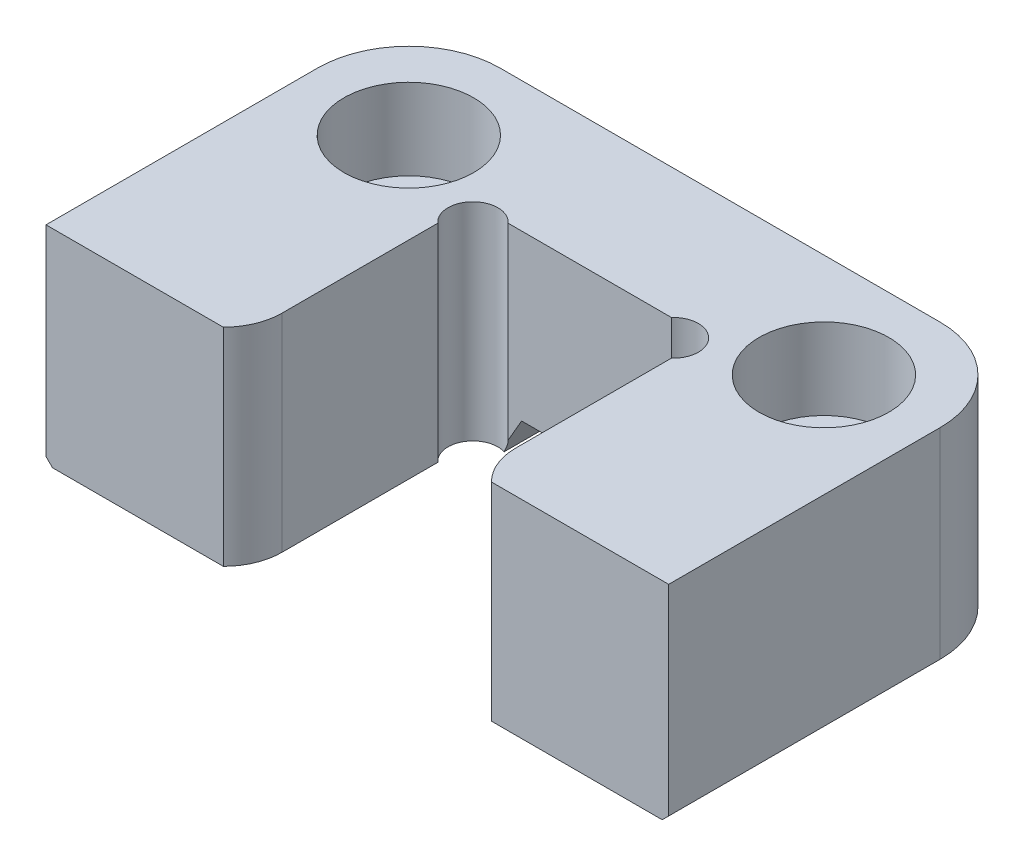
ISO-10303-21;
HEADER;
FILE_DESCRIPTION(('STEP AP214'),'2;1');
FILE_NAME('part.step','',(''),(''),'','','');
FILE_SCHEMA(('AUTOMOTIVE_DESIGN { 1 0 10303 214 1 1 1 1 }'));
ENDSEC;
DATA;
#1=APPLICATION_CONTEXT('core data for automotive mechanical design processes');
#2=APPLICATION_PROTOCOL_DEFINITION('international standard','automotive_design',2000,#1);
#3=PRODUCT_CONTEXT('',#1,'mechanical');
#4=PRODUCT('Part','Part','',(#3));
#5=PRODUCT_RELATED_PRODUCT_CATEGORY('part','',(#4));
#6=PRODUCT_DEFINITION_FORMATION('','',#4);
#7=PRODUCT_DEFINITION_CONTEXT('part definition',#1,'design');
#8=PRODUCT_DEFINITION('design','',#6,#7);
#9=PRODUCT_DEFINITION_SHAPE('','',#8);
#10=(LENGTH_UNIT() NAMED_UNIT(*) SI_UNIT(.MILLI.,.METRE.));
#11=(NAMED_UNIT(*) PLANE_ANGLE_UNIT() SI_UNIT($,.RADIAN.));
#12=(NAMED_UNIT(*) SI_UNIT($,.STERADIAN.) SOLID_ANGLE_UNIT());
#13=UNCERTAINTY_MEASURE_WITH_UNIT(LENGTH_MEASURE(1.E-05),#10,'distance_accuracy_value','');
#14=(GEOMETRIC_REPRESENTATION_CONTEXT(3) GLOBAL_UNCERTAINTY_ASSIGNED_CONTEXT((#13)) GLOBAL_UNIT_ASSIGNED_CONTEXT((#10,
#11,#12)) REPRESENTATION_CONTEXT('',''));
#15=CARTESIAN_POINT('',(0.,0.,0.));
#16=DIRECTION('',(0.,0.,1.));
#17=DIRECTION('',(1.,0.,0.));
#18=AXIS2_PLACEMENT_3D('',#15,#16,#17);
#19=CARTESIAN_POINT('',(-19.05,-12.6746,-22.1996));
#20=DIRECTION('',(0.,-1.,0.));
#21=DIRECTION('',(0.,0.,-1.));
#22=AXIS2_PLACEMENT_3D('',#19,#20,#21);
#23=PLANE('',#22);
#24=CARTESIAN_POINT('',(-12.7,-12.6746,-15.8496));
#25=DIRECTION('',(0.,1.,0.));
#26=DIRECTION('',(0.,0.,1.));
#27=AXIS2_PLACEMENT_3D('',#24,#25,#26);
#28=CIRCLE('',#27,2.2479);
#29=CARTESIAN_POINT('',(-12.7,-12.6746,-13.6017));
#30=VERTEX_POINT('',#29);
#31=EDGE_CURVE('E494',#30,#30,#28,.T.);
#32=ORIENTED_EDGE('',*,*,#31,.T.);
#33=EDGE_LOOP('',(#32));
#34=FACE_BOUND('',#33,.T.);
#35=CARTESIAN_POINT('',(-13.462,-12.6746,-16.6116));
#36=DIRECTION('',(0.,-1.,0.));
#37=DIRECTION('',(0.,0.,-1.));
#38=AXIS2_PLACEMENT_3D('',#35,#36,#37);
#39=CIRCLE('',#38,5.19112499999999);
#40=CARTESIAN_POINT('',(-18.653125,-12.6746,-16.6116));
#41=VERTEX_POINT('',#40);
#42=CARTESIAN_POINT('',(-13.462,-12.6746,-21.802725));
#43=VERTEX_POINT('',#42);
#44=EDGE_CURVE('E346',#41,#43,#39,.T.);
#45=ORIENTED_EDGE('',*,*,#44,.T.);
#46=DIRECTION('',(1.,0.,0.));
#47=VECTOR('',#46,1.);
#48=CARTESIAN_POINT('',(-19.05,-12.6746,-21.802725));
#49=LINE('',#48,#47);
#50=CARTESIAN_POINT('',(-5.67904355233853,-12.6746,-21.802725));
#51=VERTEX_POINT('',#50);
#52=EDGE_CURVE('E348',#43,#51,#49,.T.);
#53=ORIENTED_EDGE('',*,*,#52,.T.);
#54=DIRECTION('',(0.,0.,-1.));
#55=VECTOR('',#54,1.);
#56=CARTESIAN_POINT('',(-5.67904355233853,-12.6746,0.));
#57=LINE('',#56,#55);
#58=CARTESIAN_POINT('',(-5.67904355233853,-12.6746,-14.6624757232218));
#59=VERTEX_POINT('',#58);
#60=EDGE_CURVE('E220',#59,#51,#57,.T.);
#61=ORIENTED_EDGE('',*,*,#60,.F.);
#62=CARTESIAN_POINT('',(-6.1341,-12.6746,-13.208));
#63=DIRECTION('',(0.,1.,0.));
#64=DIRECTION('',(0.,0.,1.));
#65=AXIS2_PLACEMENT_3D('',#62,#63,#64);
#66=CIRCLE('',#65,1.524);
#67=CARTESIAN_POINT('',(-7.1501,-12.6746,-12.0720774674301));
#68=VERTEX_POINT('',#67);
#69=EDGE_CURVE('E237',#59,#68,#66,.T.);
#70=ORIENTED_EDGE('',*,*,#69,.T.);
#71=DIRECTION('',(0.,0.,-1.));
#72=VECTOR('',#71,1.);
#73=CARTESIAN_POINT('',(-7.1501,-12.6746,0.));
#74=LINE('',#73,#72);
#75=CARTESIAN_POINT('',(-7.1501,-12.6746,-2.54));
#76=VERTEX_POINT('',#75);
#77=EDGE_CURVE('E270',#76,#68,#74,.T.);
#78=ORIENTED_EDGE('',*,*,#77,.F.);
#79=CARTESIAN_POINT('',(-10.7414602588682,-12.6746,-2.54));
#80=DIRECTION('',(0.,-1.,0.));
#81=DIRECTION('',(0.,0.,1.));
#82=AXIS2_PLACEMENT_3D('',#79,#80,#81);
#83=CIRCLE('',#82,3.59136025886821);
#84=CARTESIAN_POINT('',(-8.20250998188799,-12.6746,0.));
#85=VERTEX_POINT('',#84);
#86=EDGE_CURVE('E246',#76,#85,#83,.T.);
#87=ORIENTED_EDGE('',*,*,#86,.T.);
#88=DIRECTION('',(1.,0.,0.));
#89=VECTOR('',#88,1.);
#90=CARTESIAN_POINT('',(-19.05,-12.6746,0.));
#91=LINE('',#90,#89);
#92=CARTESIAN_POINT('',(-18.653125,-12.6746,0.));
#93=VERTEX_POINT('',#92);
#94=EDGE_CURVE('E268',#93,#85,#91,.T.);
#95=ORIENTED_EDGE('',*,*,#94,.F.);
#96=DIRECTION('',(0.,0.,-1.));
#97=VECTOR('',#96,1.);
#98=CARTESIAN_POINT('',(-18.653125,-12.6746,-22.1996));
#99=LINE('',#98,#97);
#100=EDGE_CURVE('E344',#93,#41,#99,.T.);
#101=ORIENTED_EDGE('',*,*,#100,.T.);
#102=EDGE_LOOP('',(#45,#53,#61,#70,#78,#87,#95,#101));
#103=FACE_BOUND('',#102,.T.);
#104=ADVANCED_FACE('F34',(#34,#103),#23,.T.);
#105=CARTESIAN_POINT('',(-19.05,-12.6746,0.));
#106=DIRECTION('',(-1.,0.,0.));
#107=DIRECTION('',(0.,0.,1.));
#108=AXIS2_PLACEMENT_3D('',#105,#106,#107);
#109=PLANE('',#108);
#110=DIRECTION('',(0.,1.,0.));
#111=VECTOR('',#110,1.);
#112=CARTESIAN_POINT('',(-19.05,-12.6746,-16.6116));
#113=LINE('',#112,#111);
#114=CARTESIAN_POINT('',(-19.05,0.,-16.6116));
#115=VERTEX_POINT('',#114);
#116=CARTESIAN_POINT('',(-19.05,-12.277725,-16.6116));
#117=VERTEX_POINT('',#116);
#118=EDGE_CURVE('E313',#115,#117,#113,.F.);
#119=ORIENTED_EDGE('',*,*,#118,.T.);
#120=DIRECTION('',(0.,0.,1.));
#121=VECTOR('',#120,1.);
#122=CARTESIAN_POINT('',(-19.05,-12.277725,0.));
#123=LINE('',#122,#121);
#124=CARTESIAN_POINT('',(-19.05,-12.277725,0.));
#125=VERTEX_POINT('',#124);
#126=EDGE_CURVE('E353',#117,#125,#123,.T.);
#127=ORIENTED_EDGE('',*,*,#126,.T.);
#128=DIRECTION('',(0.,1.,0.));
#129=VECTOR('',#128,1.);
#130=CARTESIAN_POINT('',(-19.05,-12.6746,0.));
#131=LINE('',#130,#129);
#132=CARTESIAN_POINT('',(-19.05,0.,0.));
#133=VERTEX_POINT('',#132);
#134=EDGE_CURVE('E279',#125,#133,#131,.T.);
#135=ORIENTED_EDGE('',*,*,#134,.T.);
#136=DIRECTION('',(0.,0.,1.));
#137=VECTOR('',#136,1.);
#138=CARTESIAN_POINT('',(-19.05,0.,0.));
#139=LINE('',#138,#137);
#140=EDGE_CURVE('E260',#115,#133,#139,.T.);
#141=ORIENTED_EDGE('',*,*,#140,.F.);
#142=EDGE_LOOP('',(#119,#127,#135,#141));
#143=FACE_BOUND('',#142,.T.);
#144=ADVANCED_FACE('F422',(#143),#109,.T.);
#145=CARTESIAN_POINT('',(-19.05,-12.6746,-22.1996));
#146=DIRECTION('',(0.,0.,-1.));
#147=DIRECTION('',(-1.,0.,0.));
#148=AXIS2_PLACEMENT_3D('',#145,#146,#147);
#149=PLANE('',#148);
#150=DIRECTION('',(0.,1.,0.));
#151=VECTOR('',#150,1.);
#152=CARTESIAN_POINT('',(13.462,-12.6746,-22.1996));
#153=LINE('',#152,#151);
#154=CARTESIAN_POINT('',(13.462,0.,-22.1996));
#155=VERTEX_POINT('',#154);
#156=CARTESIAN_POINT('',(13.462,-12.277725,-22.1996));
#157=VERTEX_POINT('',#156);
#158=EDGE_CURVE('E311',#155,#157,#153,.F.);
#159=ORIENTED_EDGE('',*,*,#158,.T.);
#160=DIRECTION('',(-1.,0.,0.));
#161=VECTOR('',#160,1.);
#162=CARTESIAN_POINT('',(-19.05,-12.277725,-22.1996));
#163=LINE('',#162,#161);
#164=CARTESIAN_POINT('',(5.44990766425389,-12.277725,-22.1996));
#165=VERTEX_POINT('',#164);
#166=EDGE_CURVE('E340',#157,#165,#163,.T.);
#167=ORIENTED_EDGE('',*,*,#166,.T.);
#168=DIRECTION('',(0.499999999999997,-0.866025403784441,0.));
#169=VECTOR('',#168,1.);
#170=CARTESIAN_POINT('',(4.7625,-11.0871,-22.1996));
#171=LINE('',#170,#169);
#172=CARTESIAN_POINT('',(4.7625,-11.0871,-22.1996));
#173=VERTEX_POINT('',#172);
#174=EDGE_CURVE('E200',#173,#165,#171,.T.);
#175=ORIENTED_EDGE('',*,*,#174,.F.);
#176=DIRECTION('',(1.,0.,0.));
#177=VECTOR('',#176,1.);
#178=CARTESIAN_POINT('',(4.7625,-11.0871,-22.1996));
#179=LINE('',#178,#177);
#180=CARTESIAN_POINT('',(-4.7625,-11.0871,-22.1996));
#181=VERTEX_POINT('',#180);
#182=EDGE_CURVE('E194',#181,#173,#179,.T.);
#183=ORIENTED_EDGE('',*,*,#182,.F.);
#184=DIRECTION('',(0.499999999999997,0.866025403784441,0.));
#185=VECTOR('',#184,1.);
#186=CARTESIAN_POINT('',(-4.7625,-11.0871,-22.1996));
#187=LINE('',#186,#185);
#188=CARTESIAN_POINT('',(-5.44990766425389,-12.277725,-22.1996));
#189=VERTEX_POINT('',#188);
#190=EDGE_CURVE('E203',#189,#181,#187,.T.);
#191=ORIENTED_EDGE('',*,*,#190,.F.);
#192=DIRECTION('',(-1.,0.,0.));
#193=VECTOR('',#192,1.);
#194=CARTESIAN_POINT('',(-19.05,-12.277725,-22.1996));
#195=LINE('',#194,#193);
#196=CARTESIAN_POINT('',(-13.462,-12.277725,-22.1996));
#197=VERTEX_POINT('',#196);
#198=EDGE_CURVE('E338',#189,#197,#195,.T.);
#199=ORIENTED_EDGE('',*,*,#198,.T.);
#200=DIRECTION('',(0.,1.,0.));
#201=VECTOR('',#200,1.);
#202=CARTESIAN_POINT('',(-13.462,-12.6746,-22.1996));
#203=LINE('',#202,#201);
#204=CARTESIAN_POINT('',(-13.462,0.,-22.1996));
#205=VERTEX_POINT('',#204);
#206=EDGE_CURVE('E309',#197,#205,#203,.T.);
#207=ORIENTED_EDGE('',*,*,#206,.T.);
#208=DIRECTION('',(-1.,0.,0.));
#209=VECTOR('',#208,1.);
#210=CARTESIAN_POINT('',(-19.05,0.,-22.1996));
#211=LINE('',#210,#209);
#212=EDGE_CURVE('E271',#155,#205,#211,.T.);
#213=ORIENTED_EDGE('',*,*,#212,.F.);
#214=EDGE_LOOP('',(#159,#167,#175,#183,#191,#199,#207,#213));
#215=FACE_BOUND('',#214,.T.);
#216=ADVANCED_FACE('F214',(#215),#149,.T.);
#217=CARTESIAN_POINT('',(19.05,-12.6746,0.));
#218=DIRECTION('',(1.,0.,0.));
#219=DIRECTION('',(0.,0.,-1.));
#220=AXIS2_PLACEMENT_3D('',#217,#218,#219);
#221=PLANE('',#220);
#222=DIRECTION('',(0.,1.,0.));
#223=VECTOR('',#222,1.);
#224=CARTESIAN_POINT('',(19.05,-12.6746,0.));
#225=LINE('',#224,#223);
#226=CARTESIAN_POINT('',(19.05,-12.277725,0.));
#227=VERTEX_POINT('',#226);
#228=CARTESIAN_POINT('',(19.05,0.,0.));
#229=VERTEX_POINT('',#228);
#230=EDGE_CURVE('E300',#227,#229,#225,.T.);
#231=ORIENTED_EDGE('',*,*,#230,.F.);
#232=DIRECTION('',(0.,0.,-1.));
#233=VECTOR('',#232,1.);
#234=CARTESIAN_POINT('',(19.05,-12.277725,0.));
#235=LINE('',#234,#233);
#236=CARTESIAN_POINT('',(19.05,-12.277725,-16.6116));
#237=VERTEX_POINT('',#236);
#238=EDGE_CURVE('E325',#227,#237,#235,.T.);
#239=ORIENTED_EDGE('',*,*,#238,.T.);
#240=DIRECTION('',(0.,1.,0.));
#241=VECTOR('',#240,1.);
#242=CARTESIAN_POINT('',(19.05,-12.6746,-16.6116));
#243=LINE('',#242,#241);
#244=CARTESIAN_POINT('',(19.05,0.,-16.6116));
#245=VERTEX_POINT('',#244);
#246=EDGE_CURVE('E302',#237,#245,#243,.T.);
#247=ORIENTED_EDGE('',*,*,#246,.T.);
#248=DIRECTION('',(0.,0.,-1.));
#249=VECTOR('',#248,1.);
#250=CARTESIAN_POINT('',(19.05,0.,0.));
#251=LINE('',#250,#249);
#252=EDGE_CURVE('E295',#229,#245,#251,.T.);
#253=ORIENTED_EDGE('',*,*,#252,.F.);
#254=EDGE_LOOP('',(#231,#239,#247,#253));
#255=FACE_BOUND('',#254,.T.);
#256=ADVANCED_FACE('F406',(#255),#221,.T.);
#257=CARTESIAN_POINT('',(7.1501,-12.6746,0.));
#258=DIRECTION('',(0.,0.,1.));
#259=DIRECTION('',(1.,0.,0.));
#260=AXIS2_PLACEMENT_3D('',#257,#258,#259);
#261=PLANE('',#260);
#262=DIRECTION('',(1.,0.,0.));
#263=VECTOR('',#262,1.);
#264=CARTESIAN_POINT('',(7.1501,-12.6746,0.));
#265=LINE('',#264,#263);
#266=CARTESIAN_POINT('',(8.20250998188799,-12.6746,0.));
#267=VERTEX_POINT('',#266);
#268=CARTESIAN_POINT('',(18.653125,-12.6746,0.));
#269=VERTEX_POINT('',#268);
#270=EDGE_CURVE('E276',#267,#269,#265,.T.);
#271=ORIENTED_EDGE('',*,*,#270,.T.);
#272=DIRECTION('',(-0.707106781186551,-0.707106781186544,0.));
#273=VECTOR('',#272,1.);
#274=CARTESIAN_POINT('',(12.9016124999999,-18.4261125,0.));
#275=LINE('',#274,#273);
#276=EDGE_CURVE('E334',#269,#227,#275,.F.);
#277=ORIENTED_EDGE('',*,*,#276,.T.);
#278=ORIENTED_EDGE('',*,*,#230,.T.);
#279=DIRECTION('',(1.,0.,0.));
#280=VECTOR('',#279,1.);
#281=CARTESIAN_POINT('',(7.1501,0.,0.));
#282=LINE('',#281,#280);
#283=CARTESIAN_POINT('',(8.20250998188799,0.,0.));
#284=VERTEX_POINT('',#283);
#285=EDGE_CURVE('E292',#284,#229,#282,.T.);
#286=ORIENTED_EDGE('',*,*,#285,.F.);
#287=DIRECTION('',(0.,1.,0.));
#288=VECTOR('',#287,1.);
#289=CARTESIAN_POINT('',(8.20250998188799,-12.6746,0.));
#290=LINE('',#289,#288);
#291=EDGE_CURVE('E264',#267,#284,#290,.T.);
#292=ORIENTED_EDGE('',*,*,#291,.F.);
#293=EDGE_LOOP('',(#271,#277,#278,#286,#292));
#294=FACE_BOUND('',#293,.T.);
#295=ADVANCED_FACE('F396',(#294),#261,.T.);
#296=CARTESIAN_POINT('',(7.1501,-12.6746,0.));
#297=DIRECTION('',(-1.,0.,0.));
#298=DIRECTION('',(0.,0.,1.));
#299=AXIS2_PLACEMENT_3D('',#296,#297,#298);
#300=PLANE('',#299);
#301=DIRECTION('',(0.,1.,0.));
#302=VECTOR('',#301,1.);
#303=CARTESIAN_POINT('',(7.1501,-12.6746,-12.0720774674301));
#304=LINE('',#303,#302);
#305=CARTESIAN_POINT('',(7.1501,-12.6746,-12.0720774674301));
#306=VERTEX_POINT('',#305);
#307=CARTESIAN_POINT('',(7.1501,0.,-12.0720774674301));
#308=VERTEX_POINT('',#307);
#309=EDGE_CURVE('E234',#306,#308,#304,.T.);
#310=ORIENTED_EDGE('',*,*,#309,.F.);
#311=DIRECTION('',(0.,0.,1.));
#312=VECTOR('',#311,1.);
#313=CARTESIAN_POINT('',(7.1501,-12.6746,0.));
#314=LINE('',#313,#312);
#315=CARTESIAN_POINT('',(7.1501,-12.6746,-2.54));
#316=VERTEX_POINT('',#315);
#317=EDGE_CURVE('E274',#306,#316,#314,.T.);
#318=ORIENTED_EDGE('',*,*,#317,.T.);
#319=DIRECTION('',(0.,1.,0.));
#320=VECTOR('',#319,1.);
#321=CARTESIAN_POINT('',(7.1501,-12.6746,-2.54));
#322=LINE('',#321,#320);
#323=CARTESIAN_POINT('',(7.1501,0.,-2.54));
#324=VERTEX_POINT('',#323);
#325=EDGE_CURVE('E261',#316,#324,#322,.T.);
#326=ORIENTED_EDGE('',*,*,#325,.T.);
#327=DIRECTION('',(0.,0.,1.));
#328=VECTOR('',#327,1.);
#329=CARTESIAN_POINT('',(7.1501,0.,0.));
#330=LINE('',#329,#328);
#331=EDGE_CURVE('E290',#308,#324,#330,.T.);
#332=ORIENTED_EDGE('',*,*,#331,.F.);
#333=EDGE_LOOP('',(#310,#318,#326,#332));
#334=FACE_BOUND('',#333,.T.);
#335=ADVANCED_FACE('F384',(#334),#300,.T.);
#336=CARTESIAN_POINT('',(-7.1501,-12.6746,-14.224));
#337=DIRECTION('',(0.,0.,1.));
#338=DIRECTION('',(1.,0.,0.));
#339=AXIS2_PLACEMENT_3D('',#336,#337,#338);
#340=PLANE('',#339);
#341=DIRECTION('',(-0.499999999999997,-0.866025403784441,0.));
#342=VECTOR('',#341,1.);
#343=CARTESIAN_POINT('',(-6.04680766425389,-13.3115861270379,-14.224));
#344=LINE('',#343,#342);
#345=CARTESIAN_POINT('',(-4.17309094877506,-10.0662135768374,-14.224));
#346=VERTEX_POINT('',#345);
#347=CARTESIAN_POINT('',(-4.9981774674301,-11.4953053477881,-14.224));
#348=VERTEX_POINT('',#347);
#349=EDGE_CURVE('E49',#346,#348,#344,.T.);
#350=ORIENTED_EDGE('',*,*,#349,.F.);
#351=DIRECTION('',(1.,0.,0.));
#352=VECTOR('',#351,1.);
#353=CARTESIAN_POINT('',(4.7625,-10.0662135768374,-14.224));
#354=LINE('',#353,#352);
#355=CARTESIAN_POINT('',(4.17309094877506,-10.0662135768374,-14.224));
#356=VERTEX_POINT('',#355);
#357=EDGE_CURVE('E368',#346,#356,#354,.T.);
#358=ORIENTED_EDGE('',*,*,#357,.T.);
#359=DIRECTION('',(-0.499999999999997,0.866025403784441,0.));
#360=VECTOR('',#359,1.);
#361=CARTESIAN_POINT('',(2.47175766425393,-7.11941788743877,-14.224));
#362=LINE('',#361,#360);
#363=CARTESIAN_POINT('',(4.99817746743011,-11.4953053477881,-14.224));
#364=VERTEX_POINT('',#363);
#365=EDGE_CURVE('E56',#364,#356,#362,.T.);
#366=ORIENTED_EDGE('',*,*,#365,.F.);
#367=DIRECTION('',(0.,1.,0.));
#368=VECTOR('',#367,1.);
#369=CARTESIAN_POINT('',(4.99817746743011,-12.6746,-14.224));
#370=LINE('',#369,#368);
#371=CARTESIAN_POINT('',(4.99817746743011,0.,-14.224));
#372=VERTEX_POINT('',#371);
#373=EDGE_CURVE('E231',#372,#364,#370,.F.);
#374=ORIENTED_EDGE('',*,*,#373,.F.);
#375=DIRECTION('',(1.,0.,0.));
#376=VECTOR('',#375,1.);
#377=CARTESIAN_POINT('',(-7.1501,0.,-14.224));
#378=LINE('',#377,#376);
#379=CARTESIAN_POINT('',(-4.99817746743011,0.,-14.224));
#380=VERTEX_POINT('',#379);
#381=EDGE_CURVE('E287',#380,#372,#378,.T.);
#382=ORIENTED_EDGE('',*,*,#381,.F.);
#383=DIRECTION('',(0.,1.,0.));
#384=VECTOR('',#383,1.);
#385=CARTESIAN_POINT('',(-4.9981774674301,-12.6746,-14.224));
#386=LINE('',#385,#384);
#387=EDGE_CURVE('E243',#348,#380,#386,.T.);
#388=ORIENTED_EDGE('',*,*,#387,.F.);
#389=EDGE_LOOP('',(#350,#358,#366,#374,#382,#388));
#390=FACE_BOUND('',#389,.T.);
#391=ADVANCED_FACE('F372',(#390),#340,.T.);
#392=CARTESIAN_POINT('',(-7.1501,-12.6746,0.));
#393=DIRECTION('',(1.,0.,0.));
#394=DIRECTION('',(0.,0.,-1.));
#395=AXIS2_PLACEMENT_3D('',#392,#393,#394);
#396=PLANE('',#395);
#397=DIRECTION('',(0.,1.,0.));
#398=VECTOR('',#397,1.);
#399=CARTESIAN_POINT('',(-7.1501,-12.6746,-12.0720774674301));
#400=LINE('',#399,#398);
#401=CARTESIAN_POINT('',(-7.1501,0.,-12.0720774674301));
#402=VERTEX_POINT('',#401);
#403=EDGE_CURVE('E239',#402,#68,#400,.F.);
#404=ORIENTED_EDGE('',*,*,#403,.F.);
#405=DIRECTION('',(0.,0.,-1.));
#406=VECTOR('',#405,1.);
#407=CARTESIAN_POINT('',(-7.1501,0.,0.));
#408=LINE('',#407,#406);
#409=CARTESIAN_POINT('',(-7.1501,0.,-2.54));
#410=VERTEX_POINT('',#409);
#411=EDGE_CURVE('E284',#410,#402,#408,.T.);
#412=ORIENTED_EDGE('',*,*,#411,.F.);
#413=DIRECTION('',(0.,1.,0.));
#414=VECTOR('',#413,1.);
#415=CARTESIAN_POINT('',(-7.1501,-12.6746,-2.54));
#416=LINE('',#415,#414);
#417=EDGE_CURVE('E258',#76,#410,#416,.T.);
#418=ORIENTED_EDGE('',*,*,#417,.F.);
#419=ORIENTED_EDGE('',*,*,#77,.T.);
#420=EDGE_LOOP('',(#404,#412,#418,#419));
#421=FACE_BOUND('',#420,.T.);
#422=ADVANCED_FACE('F445',(#421),#396,.T.);
#423=CARTESIAN_POINT('',(-19.05,-12.6746,0.));
#424=DIRECTION('',(0.,0.,1.));
#425=DIRECTION('',(1.,0.,0.));
#426=AXIS2_PLACEMENT_3D('',#423,#424,#425);
#427=PLANE('',#426);
#428=ORIENTED_EDGE('',*,*,#134,.F.);
#429=DIRECTION('',(-0.707106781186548,0.707106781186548,0.));
#430=VECTOR('',#429,1.);
#431=CARTESIAN_POINT('',(-18.8515625,-12.4761625,0.));
#432=LINE('',#431,#430);
#433=EDGE_CURVE('E355',#125,#93,#432,.F.);
#434=ORIENTED_EDGE('',*,*,#433,.T.);
#435=ORIENTED_EDGE('',*,*,#94,.T.);
#436=DIRECTION('',(0.,1.,0.));
#437=VECTOR('',#436,1.);
#438=CARTESIAN_POINT('',(-8.20250998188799,-12.6746,0.));
#439=LINE('',#438,#437);
#440=CARTESIAN_POINT('',(-8.20250998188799,0.,0.));
#441=VERTEX_POINT('',#440);
#442=EDGE_CURVE('E253',#85,#441,#439,.T.);
#443=ORIENTED_EDGE('',*,*,#442,.T.);
#444=DIRECTION('',(1.,0.,0.));
#445=VECTOR('',#444,1.);
#446=CARTESIAN_POINT('',(-19.05,0.,0.));
#447=LINE('',#446,#445);
#448=EDGE_CURVE('E282',#133,#441,#447,.T.);
#449=ORIENTED_EDGE('',*,*,#448,.F.);
#450=EDGE_LOOP('',(#428,#434,#435,#443,#449));
#451=FACE_BOUND('',#450,.T.);
#452=ADVANCED_FACE('F427',(#451),#427,.T.);
#453=CARTESIAN_POINT('',(12.7,-12.6746,-15.8496));
#454=DIRECTION('',(0.,1.,0.));
#455=DIRECTION('',(0.,0.,1.));
#456=AXIS2_PLACEMENT_3D('',#453,#454,#455);
#457=CIRCLE('',#456,2.2479);
#458=CARTESIAN_POINT('',(12.7,-12.6746,-13.6017));
#459=VERTEX_POINT('',#458);
#460=EDGE_CURVE('E364',#459,#459,#457,.T.);
#461=ORIENTED_EDGE('',*,*,#460,.T.);
#462=EDGE_LOOP('',(#461));
#463=FACE_BOUND('',#462,.T.);
#464=CARTESIAN_POINT('',(13.462,-12.6746,-16.6116));
#465=DIRECTION('',(0.,-1.,0.));
#466=DIRECTION('',(0.,0.,-1.));
#467=AXIS2_PLACEMENT_3D('',#464,#465,#466);
#468=CIRCLE('',#467,5.19112499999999);
#469=CARTESIAN_POINT('',(13.462,-12.6746,-21.802725));
#470=VERTEX_POINT('',#469);
#471=CARTESIAN_POINT('',(18.653125,-12.6746,-16.6116));
#472=VERTEX_POINT('',#471);
#473=EDGE_CURVE('E330',#470,#472,#468,.T.);
#474=ORIENTED_EDGE('',*,*,#473,.T.);
#475=DIRECTION('',(0.,0.,1.));
#476=VECTOR('',#475,1.);
#477=CARTESIAN_POINT('',(18.653125,-12.6746,-22.1996));
#478=LINE('',#477,#476);
#479=EDGE_CURVE('E332',#472,#269,#478,.T.);
#480=ORIENTED_EDGE('',*,*,#479,.T.);
#481=ORIENTED_EDGE('',*,*,#270,.F.);
#482=CARTESIAN_POINT('',(10.7414602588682,-12.6746,-2.54));
#483=DIRECTION('',(0.,-1.,0.));
#484=DIRECTION('',(0.,0.,-1.));
#485=AXIS2_PLACEMENT_3D('',#482,#483,#484);
#486=CIRCLE('',#485,3.59136025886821);
#487=EDGE_CURVE('E249',#267,#316,#486,.T.);
#488=ORIENTED_EDGE('',*,*,#487,.T.);
#489=ORIENTED_EDGE('',*,*,#317,.F.);
#490=CARTESIAN_POINT('',(6.1341,-12.6746,-13.208));
#491=DIRECTION('',(0.,1.,0.));
#492=DIRECTION('',(0.,0.,-1.));
#493=AXIS2_PLACEMENT_3D('',#490,#491,#492);
#494=CIRCLE('',#493,1.524);
#495=CARTESIAN_POINT('',(5.67904355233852,-12.6746,-14.6624757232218));
#496=VERTEX_POINT('',#495);
#497=EDGE_CURVE('E228',#306,#496,#494,.T.);
#498=ORIENTED_EDGE('',*,*,#497,.T.);
#499=DIRECTION('',(0.,0.,-1.));
#500=VECTOR('',#499,1.);
#501=CARTESIAN_POINT('',(5.67904355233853,-12.6746,0.));
#502=LINE('',#501,#500);
#503=CARTESIAN_POINT('',(5.67904355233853,-12.6746,-21.802725));
#504=VERTEX_POINT('',#503);
#505=EDGE_CURVE('E222',#496,#504,#502,.T.);
#506=ORIENTED_EDGE('',*,*,#505,.T.);
#507=DIRECTION('',(1.,0.,0.));
#508=VECTOR('',#507,1.);
#509=CARTESIAN_POINT('',(-19.05,-12.6746,-21.802725));
#510=LINE('',#509,#508);
#511=EDGE_CURVE('E328',#504,#470,#510,.T.);
#512=ORIENTED_EDGE('',*,*,#511,.T.);
#513=EDGE_LOOP('',(#474,#480,#481,#488,#489,#498,#506,#512));
#514=FACE_BOUND('',#513,.T.);
#515=ADVANCED_FACE('F392',(#463,#514),#23,.T.);
#516=CARTESIAN_POINT('',(-19.05,0.,-22.1996));
#517=DIRECTION('',(0.,-1.,0.));
#518=DIRECTION('',(0.,0.,-1.));
#519=AXIS2_PLACEMENT_3D('',#516,#517,#518);
#520=PLANE('',#519);
#521=CARTESIAN_POINT('',(-12.7,0.,-15.8496));
#522=DIRECTION('',(0.,1.,0.));
#523=DIRECTION('',(0.,0.,1.));
#524=AXIS2_PLACEMENT_3D('',#521,#522,#523);
#525=CIRCLE('',#524,3.96875);
#526=CARTESIAN_POINT('',(-12.7,0.,-11.88085));
#527=VERTEX_POINT('',#526);
#528=EDGE_CURVE('E502',#527,#527,#525,.T.);
#529=ORIENTED_EDGE('',*,*,#528,.F.);
#530=EDGE_LOOP('',(#529));
#531=FACE_BOUND('',#530,.T.);
#532=CARTESIAN_POINT('',(12.7,0.,-15.8496));
#533=DIRECTION('',(0.,1.,0.));
#534=DIRECTION('',(0.,0.,1.));
#535=AXIS2_PLACEMENT_3D('',#532,#533,#534);
#536=CIRCLE('',#535,3.96875);
#537=CARTESIAN_POINT('',(12.7,0.,-11.88085));
#538=VERTEX_POINT('',#537);
#539=EDGE_CURVE('E491',#538,#538,#536,.T.);
#540=ORIENTED_EDGE('',*,*,#539,.F.);
#541=EDGE_LOOP('',(#540));
#542=FACE_BOUND('',#541,.T.);
#543=ORIENTED_EDGE('',*,*,#381,.T.);
#544=CARTESIAN_POINT('',(6.1341,0.,-13.208));
#545=DIRECTION('',(0.,-1.,0.));
#546=DIRECTION('',(0.,0.,-1.));
#547=AXIS2_PLACEMENT_3D('',#544,#545,#546);
#548=CIRCLE('',#547,1.524);
#549=EDGE_CURVE('E316',#372,#308,#548,.T.);
#550=ORIENTED_EDGE('',*,*,#549,.T.);
#551=ORIENTED_EDGE('',*,*,#331,.T.);
#552=CARTESIAN_POINT('',(10.7414602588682,0.,-2.54));
#553=DIRECTION('',(0.,-1.,0.));
#554=DIRECTION('',(0.,0.,-1.));
#555=AXIS2_PLACEMENT_3D('',#552,#553,#554);
#556=CIRCLE('',#555,3.59136025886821);
#557=EDGE_CURVE('E250',#284,#324,#556,.T.);
#558=ORIENTED_EDGE('',*,*,#557,.F.);
#559=ORIENTED_EDGE('',*,*,#285,.T.);
#560=ORIENTED_EDGE('',*,*,#252,.T.);
#561=CARTESIAN_POINT('',(13.462,0.,-16.6116));
#562=DIRECTION('',(0.,-1.,0.));
#563=DIRECTION('',(0.,0.,-1.));
#564=AXIS2_PLACEMENT_3D('',#561,#562,#563);
#565=CIRCLE('',#564,5.588);
#566=EDGE_CURVE('E307',#245,#155,#565,.F.);
#567=ORIENTED_EDGE('',*,*,#566,.T.);
#568=ORIENTED_EDGE('',*,*,#212,.T.);
#569=CARTESIAN_POINT('',(-13.462,0.,-16.6116));
#570=DIRECTION('',(0.,-1.,0.));
#571=DIRECTION('',(0.,0.,-1.));
#572=AXIS2_PLACEMENT_3D('',#569,#570,#571);
#573=CIRCLE('',#572,5.588);
#574=EDGE_CURVE('E305',#205,#115,#573,.F.);
#575=ORIENTED_EDGE('',*,*,#574,.T.);
#576=ORIENTED_EDGE('',*,*,#140,.T.);
#577=ORIENTED_EDGE('',*,*,#448,.T.);
#578=CARTESIAN_POINT('',(-10.7414602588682,0.,-2.54));
#579=DIRECTION('',(0.,-1.,0.));
#580=DIRECTION('',(0.,0.,1.));
#581=AXIS2_PLACEMENT_3D('',#578,#579,#580);
#582=CIRCLE('',#581,3.59136025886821);
#583=EDGE_CURVE('E245',#410,#441,#582,.T.);
#584=ORIENTED_EDGE('',*,*,#583,.F.);
#585=ORIENTED_EDGE('',*,*,#411,.T.);
#586=CARTESIAN_POINT('',(-6.1341,0.,-13.208));
#587=DIRECTION('',(0.,1.,0.));
#588=DIRECTION('',(0.,0.,1.));
#589=AXIS2_PLACEMENT_3D('',#586,#587,#588);
#590=CIRCLE('',#589,1.524);
#591=EDGE_CURVE('E236',#380,#402,#590,.T.);
#592=ORIENTED_EDGE('',*,*,#591,.F.);
#593=EDGE_LOOP('',(#543,#550,#551,#558,#559,#560,#567,#568,#575,#576,#577,#584,#585,#592));
#594=FACE_BOUND('',#593,.T.);
#595=ADVANCED_FACE('F380',(#531,#542,#594),#520,.F.);
#596=CARTESIAN_POINT('',(13.462,-12.6746,-16.6116));
#597=DIRECTION('',(0.,1.,0.));
#598=DIRECTION('',(0.,0.,1.));
#599=AXIS2_PLACEMENT_3D('',#596,#597,#598);
#600=CYLINDRICAL_SURFACE('',#599,5.588);
#601=ORIENTED_EDGE('',*,*,#246,.F.);
#602=CARTESIAN_POINT('',(13.462,-12.277725,-16.6116));
#603=DIRECTION('',(0.,-1.,0.));
#604=DIRECTION('',(0.,0.,-1.));
#605=AXIS2_PLACEMENT_3D('',#602,#603,#604);
#606=CIRCLE('',#605,5.588);
#607=EDGE_CURVE('E336',#237,#157,#606,.F.);
#608=ORIENTED_EDGE('',*,*,#607,.T.);
#609=ORIENTED_EDGE('',*,*,#158,.F.);
#610=ORIENTED_EDGE('',*,*,#566,.F.);
#611=EDGE_LOOP('',(#601,#608,#609,#610));
#612=FACE_BOUND('',#611,.T.);
#613=ADVANCED_FACE('F410',(#612),#600,.T.);
#614=CARTESIAN_POINT('',(-13.462,-12.6746,-16.6116));
#615=DIRECTION('',(0.,1.,0.));
#616=DIRECTION('',(0.,0.,1.));
#617=AXIS2_PLACEMENT_3D('',#614,#615,#616);
#618=CYLINDRICAL_SURFACE('',#617,5.588);
#619=ORIENTED_EDGE('',*,*,#206,.F.);
#620=CARTESIAN_POINT('',(-13.462,-12.277725,-16.6116));
#621=DIRECTION('',(0.,-1.,0.));
#622=DIRECTION('',(0.,0.,-1.));
#623=AXIS2_PLACEMENT_3D('',#620,#621,#622);
#624=CIRCLE('',#623,5.588);
#625=EDGE_CURVE('E351',#197,#117,#624,.F.);
#626=ORIENTED_EDGE('',*,*,#625,.T.);
#627=ORIENTED_EDGE('',*,*,#118,.F.);
#628=ORIENTED_EDGE('',*,*,#574,.F.);
#629=EDGE_LOOP('',(#619,#626,#627,#628));
#630=FACE_BOUND('',#629,.T.);
#631=ADVANCED_FACE('F418',(#630),#618,.T.);
#632=CARTESIAN_POINT('',(10.7414602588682,-12.6746,-2.54));
#633=DIRECTION('',(0.,1.,0.));
#634=DIRECTION('',(0.,0.,1.));
#635=AXIS2_PLACEMENT_3D('',#632,#633,#634);
#636=CYLINDRICAL_SURFACE('',#635,3.59136025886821);
#637=ORIENTED_EDGE('',*,*,#557,.T.);
#638=ORIENTED_EDGE('',*,*,#325,.F.);
#639=ORIENTED_EDGE('',*,*,#487,.F.);
#640=ORIENTED_EDGE('',*,*,#291,.T.);
#641=EDGE_LOOP('',(#637,#638,#639,#640));
#642=FACE_BOUND('',#641,.T.);
#643=ADVANCED_FACE('F388',(#642),#636,.T.);
#644=CARTESIAN_POINT('',(-10.7414602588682,-12.6746,-2.54));
#645=DIRECTION('',(0.,1.,0.));
#646=DIRECTION('',(0.,0.,1.));
#647=AXIS2_PLACEMENT_3D('',#644,#645,#646);
#648=CYLINDRICAL_SURFACE('',#647,3.59136025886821);
#649=ORIENTED_EDGE('',*,*,#583,.T.);
#650=ORIENTED_EDGE('',*,*,#442,.F.);
#651=ORIENTED_EDGE('',*,*,#86,.F.);
#652=ORIENTED_EDGE('',*,*,#417,.T.);
#653=EDGE_LOOP('',(#649,#650,#651,#652));
#654=FACE_BOUND('',#653,.T.);
#655=ADVANCED_FACE('F439',(#654),#648,.T.);
#656=CARTESIAN_POINT('',(-6.1341,-12.6746,-13.208));
#657=DIRECTION('',(0.,1.,0.));
#658=DIRECTION('',(0.,0.,1.));
#659=AXIS2_PLACEMENT_3D('',#656,#657,#658);
#660=CYLINDRICAL_SURFACE('',#659,1.524);
#661=ORIENTED_EDGE('',*,*,#69,.F.);
#662=CARTESIAN_POINT('',(-6.1341,-13.4627808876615,-13.208));
#663=DIRECTION('',(-0.866025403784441,0.499999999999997,0.));
#664=DIRECTION('',(0.499999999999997,0.866025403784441,0.));
#665=AXIS2_PLACEMENT_3D('',#662,#663,#664);
#666=ELLIPSE('',#665,3.04800000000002,1.524);
#667=EDGE_CURVE('E322',#59,#348,#666,.F.);
#668=ORIENTED_EDGE('',*,*,#667,.T.);
#669=ORIENTED_EDGE('',*,*,#387,.T.);
#670=ORIENTED_EDGE('',*,*,#591,.T.);
#671=ORIENTED_EDGE('',*,*,#403,.T.);
#672=EDGE_LOOP('',(#661,#668,#669,#670,#671));
#673=FACE_BOUND('',#672,.T.);
#674=ADVANCED_FACE('F448',(#673),#660,.F.);
#675=CARTESIAN_POINT('',(6.1341,-12.6746,-13.208));
#676=DIRECTION('',(0.,1.,0.));
#677=DIRECTION('',(0.,0.,1.));
#678=AXIS2_PLACEMENT_3D('',#675,#676,#677);
#679=CYLINDRICAL_SURFACE('',#678,1.524);
#680=ORIENTED_EDGE('',*,*,#373,.T.);
#681=CARTESIAN_POINT('',(6.1341,-13.4627808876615,-13.208));
#682=DIRECTION('',(0.866025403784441,0.499999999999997,0.));
#683=DIRECTION('',(-0.499999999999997,0.866025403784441,0.));
#684=AXIS2_PLACEMENT_3D('',#681,#682,#683);
#685=ELLIPSE('',#684,3.04800000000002,1.524);
#686=EDGE_CURVE('E319',#364,#496,#685,.F.);
#687=ORIENTED_EDGE('',*,*,#686,.T.);
#688=ORIENTED_EDGE('',*,*,#497,.F.);
#689=ORIENTED_EDGE('',*,*,#309,.T.);
#690=ORIENTED_EDGE('',*,*,#549,.F.);
#691=EDGE_LOOP('',(#680,#687,#688,#689,#690));
#692=FACE_BOUND('',#691,.T.);
#693=ADVANCED_FACE('F376',(#692),#679,.F.);
#694=CARTESIAN_POINT('',(-4.7625,-11.0871,0.));
#695=DIRECTION('',(-0.866025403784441,0.499999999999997,0.));
#696=DIRECTION('',(-0.499999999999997,-0.866025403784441,0.));
#697=AXIS2_PLACEMENT_3D('',#694,#695,#696);
#698=PLANE('',#697);
#699=ORIENTED_EDGE('',*,*,#60,.T.);
#700=DIRECTION('',(-0.377964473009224,-0.654653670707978,0.654653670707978));
#701=VECTOR('',#700,1.);
#702=CARTESIAN_POINT('',(-7.39277799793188,-15.6428751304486,-18.8344498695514));
#703=LINE('',#702,#701);
#704=EDGE_CURVE('E207',#51,#189,#703,.F.);
#705=ORIENTED_EDGE('',*,*,#704,.T.);
#706=ORIENTED_EDGE('',*,*,#190,.T.);
#707=DIRECTION('',(0.,0.,-1.));
#708=VECTOR('',#707,1.);
#709=CARTESIAN_POINT('',(-4.7625,-11.0871,0.));
#710=LINE('',#709,#708);
#711=CARTESIAN_POINT('',(-4.7625,-11.0871,-18.0340000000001));
#712=VERTEX_POINT('',#711);
#713=EDGE_CURVE('E189',#712,#181,#710,.T.);
#714=ORIENTED_EDGE('',*,*,#713,.F.);
#715=DIRECTION('',(0.147788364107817,0.255976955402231,0.955319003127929));
#716=VECTOR('',#715,1.);
#717=CARTESIAN_POINT('',(-2.21636912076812,-6.67707195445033,-1.57555127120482));
#718=LINE('',#717,#716);
#719=EDGE_CURVE('E42',#712,#346,#718,.T.);
#720=ORIENTED_EDGE('',*,*,#719,.T.);
#721=ORIENTED_EDGE('',*,*,#349,.T.);
#722=ORIENTED_EDGE('',*,*,#667,.F.);
#723=EDGE_LOOP('',(#699,#705,#706,#714,#720,#721,#722));
#724=FACE_BOUND('',#723,.T.);
#725=ADVANCED_FACE('F205',(#724),#698,.F.);
#726=CARTESIAN_POINT('',(4.7625,-11.0871,0.));
#727=DIRECTION('',(0.866025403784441,0.499999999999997,0.));
#728=DIRECTION('',(-0.499999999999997,0.866025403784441,0.));
#729=AXIS2_PLACEMENT_3D('',#726,#727,#728);
#730=PLANE('',#729);
#731=ORIENTED_EDGE('',*,*,#174,.T.);
#732=DIRECTION('',(-0.377964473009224,0.654653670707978,-0.654653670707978));
#733=VECTOR('',#732,1.);
#734=CARTESIAN_POINT('',(1.94992085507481,-6.21557002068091,-28.2617549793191));
#735=LINE('',#734,#733);
#736=EDGE_CURVE('E342',#165,#504,#735,.F.);
#737=ORIENTED_EDGE('',*,*,#736,.T.);
#738=ORIENTED_EDGE('',*,*,#505,.F.);
#739=ORIENTED_EDGE('',*,*,#686,.F.);
#740=ORIENTED_EDGE('',*,*,#365,.T.);
#741=DIRECTION('',(0.147788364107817,-0.255976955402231,-0.955319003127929));
#742=VECTOR('',#741,1.);
#743=CARTESIAN_POINT('',(2.21636912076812,-6.67707195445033,-1.57555127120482));
#744=LINE('',#743,#742);
#745=CARTESIAN_POINT('',(4.7625,-11.0871,-18.0340000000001));
#746=VERTEX_POINT('',#745);
#747=EDGE_CURVE('E11',#356,#746,#744,.T.);
#748=ORIENTED_EDGE('',*,*,#747,.T.);
#749=DIRECTION('',(0.,0.,-1.));
#750=VECTOR('',#749,1.);
#751=CARTESIAN_POINT('',(4.7625,-11.0871,0.));
#752=LINE('',#751,#750);
#753=EDGE_CURVE('E199',#746,#173,#752,.T.);
#754=ORIENTED_EDGE('',*,*,#753,.T.);
#755=EDGE_LOOP('',(#731,#737,#738,#739,#740,#748,#754));
#756=FACE_BOUND('',#755,.T.);
#757=ADVANCED_FACE('F531',(#756),#730,.F.);
#758=CARTESIAN_POINT('',(4.7625,-11.0871,0.));
#759=DIRECTION('',(0.,1.,0.));
#760=DIRECTION('',(0.,0.,1.));
#761=AXIS2_PLACEMENT_3D('',#758,#759,#760);
#762=PLANE('',#761);
#763=ORIENTED_EDGE('',*,*,#753,.F.);
#764=DIRECTION('',(-1.,0.,0.));
#765=VECTOR('',#764,1.);
#766=CARTESIAN_POINT('',(-4.7625,-11.0871,-18.0340000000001));
#767=LINE('',#766,#765);
#768=EDGE_CURVE('E197',#746,#712,#767,.T.);
#769=ORIENTED_EDGE('',*,*,#768,.T.);
#770=ORIENTED_EDGE('',*,*,#713,.T.);
#771=ORIENTED_EDGE('',*,*,#182,.T.);
#772=EDGE_LOOP('',(#763,#769,#770,#771));
#773=FACE_BOUND('',#772,.T.);
#774=ADVANCED_FACE('F192',(#773),#762,.F.);
#775=CARTESIAN_POINT('',(-19.05,-12.277725,-22.1996));
#776=DIRECTION('',(0.,0.707106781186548,0.707106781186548));
#777=DIRECTION('',(0.,-0.707106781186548,0.707106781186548));
#778=AXIS2_PLACEMENT_3D('',#775,#776,#777);
#779=PLANE('',#778);
#780=ORIENTED_EDGE('',*,*,#736,.F.);
#781=ORIENTED_EDGE('',*,*,#166,.F.);
#782=DIRECTION('',(0.,0.707106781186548,-0.707106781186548));
#783=VECTOR('',#782,1.);
#784=CARTESIAN_POINT('',(13.462,-12.6746,-21.802725));
#785=LINE('',#784,#783);
#786=EDGE_CURVE('E211',#470,#157,#785,.T.);
#787=ORIENTED_EDGE('',*,*,#786,.F.);
#788=ORIENTED_EDGE('',*,*,#511,.F.);
#789=EDGE_LOOP('',(#780,#781,#787,#788));
#790=FACE_BOUND('',#789,.T.);
#791=ADVANCED_FACE('F536',(#790),#779,.F.);
#792=CARTESIAN_POINT('',(13.462,-12.6746,-16.6116));
#793=DIRECTION('',(0.,1.,0.));
#794=DIRECTION('',(0.,0.,1.));
#795=AXIS2_PLACEMENT_3D('',#792,#793,#794);
#796=CONICAL_SURFACE('',#795,5.19112499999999,0.785398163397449);
#797=ORIENTED_EDGE('',*,*,#786,.T.);
#798=ORIENTED_EDGE('',*,*,#607,.F.);
#799=DIRECTION('',(0.707106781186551,0.707106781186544,0.));
#800=VECTOR('',#799,1.);
#801=CARTESIAN_POINT('',(18.653125,-12.6746,-16.6116));
#802=LINE('',#801,#800);
#803=EDGE_CURVE('E357',#472,#237,#802,.T.);
#804=ORIENTED_EDGE('',*,*,#803,.F.);
#805=ORIENTED_EDGE('',*,*,#473,.F.);
#806=EDGE_LOOP('',(#797,#798,#804,#805));
#807=FACE_BOUND('',#806,.T.);
#808=ADVANCED_FACE('F581',(#807),#796,.T.);
#809=CARTESIAN_POINT('',(19.05,-12.277725,0.));
#810=DIRECTION('',(-0.707106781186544,0.707106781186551,0.));
#811=DIRECTION('',(-0.707106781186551,-0.707106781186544,0.));
#812=AXIS2_PLACEMENT_3D('',#809,#810,#811);
#813=PLANE('',#812);
#814=ORIENTED_EDGE('',*,*,#276,.F.);
#815=ORIENTED_EDGE('',*,*,#479,.F.);
#816=ORIENTED_EDGE('',*,*,#803,.T.);
#817=ORIENTED_EDGE('',*,*,#238,.F.);
#818=EDGE_LOOP('',(#814,#815,#816,#817));
#819=FACE_BOUND('',#818,.T.);
#820=ADVANCED_FACE('F401',(#819),#813,.F.);
#821=CARTESIAN_POINT('',(-19.05,-12.277725,0.));
#822=DIRECTION('',(0.707106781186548,0.707106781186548,0.));
#823=DIRECTION('',(-0.707106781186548,0.707106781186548,0.));
#824=AXIS2_PLACEMENT_3D('',#821,#822,#823);
#825=PLANE('',#824);
#826=ORIENTED_EDGE('',*,*,#433,.F.);
#827=ORIENTED_EDGE('',*,*,#126,.F.);
#828=DIRECTION('',(-0.707106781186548,0.707106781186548,0.));
#829=VECTOR('',#828,1.);
#830=CARTESIAN_POINT('',(-18.653125,-12.6746,-16.6116));
#831=LINE('',#830,#829);
#832=EDGE_CURVE('E359',#41,#117,#831,.T.);
#833=ORIENTED_EDGE('',*,*,#832,.F.);
#834=ORIENTED_EDGE('',*,*,#100,.F.);
#835=EDGE_LOOP('',(#826,#827,#833,#834));
#836=FACE_BOUND('',#835,.T.);
#837=ADVANCED_FACE('F431',(#836),#825,.F.);
#838=CARTESIAN_POINT('',(-13.462,-12.6746,-16.6116));
#839=DIRECTION('',(0.,1.,0.));
#840=DIRECTION('',(0.,0.,1.));
#841=AXIS2_PLACEMENT_3D('',#838,#839,#840);
#842=CONICAL_SURFACE('',#841,5.19112499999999,0.785398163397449);
#843=ORIENTED_EDGE('',*,*,#832,.T.);
#844=ORIENTED_EDGE('',*,*,#625,.F.);
#845=DIRECTION('',(0.,0.707106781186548,-0.707106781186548));
#846=VECTOR('',#845,1.);
#847=CARTESIAN_POINT('',(-13.462,-12.6746,-21.802725));
#848=LINE('',#847,#846);
#849=EDGE_CURVE('E362',#43,#197,#848,.T.);
#850=ORIENTED_EDGE('',*,*,#849,.F.);
#851=ORIENTED_EDGE('',*,*,#44,.F.);
#852=EDGE_LOOP('',(#843,#844,#850,#851));
#853=FACE_BOUND('',#852,.T.);
#854=ADVANCED_FACE('F455',(#853),#842,.T.);
#855=CARTESIAN_POINT('',(-19.05,-12.277725,-22.1996));
#856=DIRECTION('',(0.,0.707106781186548,0.707106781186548));
#857=DIRECTION('',(0.,-0.707106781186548,0.707106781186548));
#858=AXIS2_PLACEMENT_3D('',#855,#856,#857);
#859=PLANE('',#858);
#860=ORIENTED_EDGE('',*,*,#704,.F.);
#861=ORIENTED_EDGE('',*,*,#52,.F.);
#862=ORIENTED_EDGE('',*,*,#849,.T.);
#863=ORIENTED_EDGE('',*,*,#198,.F.);
#864=EDGE_LOOP('',(#860,#861,#862,#863));
#865=FACE_BOUND('',#864,.T.);
#866=ADVANCED_FACE('F452',(#865),#859,.F.);
#867=CARTESIAN_POINT('',(4.7625,-11.0871,-18.0340000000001));
#868=DIRECTION('',(0.,-0.965925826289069,0.258819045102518));
#869=DIRECTION('',(0.,-0.258819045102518,-0.965925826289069));
#870=AXIS2_PLACEMENT_3D('',#867,#868,#869);
#871=PLANE('',#870);
#872=ORIENTED_EDGE('',*,*,#747,.F.);
#873=ORIENTED_EDGE('',*,*,#357,.F.);
#874=ORIENTED_EDGE('',*,*,#719,.F.);
#875=ORIENTED_EDGE('',*,*,#768,.F.);
#876=EDGE_LOOP('',(#872,#873,#874,#875));
#877=FACE_BOUND('',#876,.T.);
#878=ADVANCED_FACE('F36',(#877),#871,.T.);
#879=CARTESIAN_POINT('',(12.7,0.,-15.8496));
#880=DIRECTION('',(0.,1.,0.));
#881=DIRECTION('',(0.,0.,1.));
#882=AXIS2_PLACEMENT_3D('',#879,#880,#881);
#883=CYLINDRICAL_SURFACE('',#882,2.2479);
#884=ORIENTED_EDGE('',*,*,#460,.F.);
#885=EDGE_LOOP('',(#884));
#886=FACE_BOUND('',#885,.T.);
#887=CARTESIAN_POINT('',(12.7,-4.96062,-15.8496));
#888=DIRECTION('',(0.,1.,0.));
#889=DIRECTION('',(0.,0.,1.));
#890=AXIS2_PLACEMENT_3D('',#887,#888,#889);
#891=CIRCLE('',#890,2.2479);
#892=CARTESIAN_POINT('',(12.7,-4.96062,-13.6017));
#893=VERTEX_POINT('',#892);
#894=EDGE_CURVE('E484',#893,#893,#891,.T.);
#895=ORIENTED_EDGE('',*,*,#894,.T.);
#896=EDGE_LOOP('',(#895));
#897=FACE_BOUND('',#896,.T.);
#898=ADVANCED_FACE('F523',(#886,#897),#883,.F.);
#899=CARTESIAN_POINT('',(14.9479,-4.96062,-15.8496));
#900=DIRECTION('',(0.,-1.,0.));
#901=DIRECTION('',(0.,0.,-1.));
#902=AXIS2_PLACEMENT_3D('',#899,#900,#901);
#903=PLANE('',#902);
#904=ORIENTED_EDGE('',*,*,#894,.F.);
#905=EDGE_LOOP('',(#904));
#906=FACE_BOUND('',#905,.T.);
#907=CARTESIAN_POINT('',(12.7,-4.96062,-15.8496));
#908=DIRECTION('',(0.,1.,0.));
#909=DIRECTION('',(0.,0.,1.));
#910=AXIS2_PLACEMENT_3D('',#907,#908,#909);
#911=CIRCLE('',#910,3.96875);
#912=CARTESIAN_POINT('',(12.7,-4.96062,-11.88085));
#913=VERTEX_POINT('',#912);
#914=EDGE_CURVE('E486',#913,#913,#911,.T.);
#915=ORIENTED_EDGE('',*,*,#914,.T.);
#916=EDGE_LOOP('',(#915));
#917=FACE_BOUND('',#916,.T.);
#918=ADVANCED_FACE('F513',(#906,#917),#903,.F.);
#919=CARTESIAN_POINT('',(12.7,0.,-15.8496));
#920=DIRECTION('',(0.,1.,0.));
#921=DIRECTION('',(0.,0.,1.));
#922=AXIS2_PLACEMENT_3D('',#919,#920,#921);
#923=CYLINDRICAL_SURFACE('',#922,3.96875);
#924=ORIENTED_EDGE('',*,*,#914,.F.);
#925=EDGE_LOOP('',(#924));
#926=FACE_BOUND('',#925,.T.);
#927=ORIENTED_EDGE('',*,*,#539,.T.);
#928=EDGE_LOOP('',(#927));
#929=FACE_BOUND('',#928,.T.);
#930=ADVANCED_FACE('F510',(#926,#929),#923,.F.);
#931=CARTESIAN_POINT('',(-12.7,0.,-15.8496));
#932=DIRECTION('',(0.,1.,0.));
#933=DIRECTION('',(0.,0.,1.));
#934=AXIS2_PLACEMENT_3D('',#931,#932,#933);
#935=CYLINDRICAL_SURFACE('',#934,2.2479);
#936=ORIENTED_EDGE('',*,*,#31,.F.);
#937=EDGE_LOOP('',(#936));
#938=FACE_BOUND('',#937,.T.);
#939=CARTESIAN_POINT('',(-12.7,-4.96062,-15.8496));
#940=DIRECTION('',(0.,1.,0.));
#941=DIRECTION('',(0.,0.,1.));
#942=AXIS2_PLACEMENT_3D('',#939,#940,#941);
#943=CIRCLE('',#942,2.2479);
#944=CARTESIAN_POINT('',(-12.7,-4.96062,-13.6017));
#945=VERTEX_POINT('',#944);
#946=EDGE_CURVE('E496',#945,#945,#943,.T.);
#947=ORIENTED_EDGE('',*,*,#946,.T.);
#948=EDGE_LOOP('',(#947));
#949=FACE_BOUND('',#948,.T.);
#950=ADVANCED_FACE('F512',(#938,#949),#935,.F.);
#951=CARTESIAN_POINT('',(-10.4521,-4.96062,-15.8496));
#952=DIRECTION('',(0.,-1.,0.));
#953=DIRECTION('',(0.,0.,-1.));
#954=AXIS2_PLACEMENT_3D('',#951,#952,#953);
#955=PLANE('',#954);
#956=ORIENTED_EDGE('',*,*,#946,.F.);
#957=EDGE_LOOP('',(#956));
#958=FACE_BOUND('',#957,.T.);
#959=CARTESIAN_POINT('',(-12.7,-4.96062,-15.8496));
#960=DIRECTION('',(0.,1.,0.));
#961=DIRECTION('',(0.,0.,1.));
#962=AXIS2_PLACEMENT_3D('',#959,#960,#961);
#963=CIRCLE('',#962,3.96875);
#964=CARTESIAN_POINT('',(-12.7,-4.96062,-11.88085));
#965=VERTEX_POINT('',#964);
#966=EDGE_CURVE('E499',#965,#965,#963,.T.);
#967=ORIENTED_EDGE('',*,*,#966,.T.);
#968=EDGE_LOOP('',(#967));
#969=FACE_BOUND('',#968,.T.);
#970=ADVANCED_FACE('F520',(#958,#969),#955,.F.);
#971=CARTESIAN_POINT('',(-12.7,0.,-15.8496));
#972=DIRECTION('',(0.,1.,0.));
#973=DIRECTION('',(0.,0.,1.));
#974=AXIS2_PLACEMENT_3D('',#971,#972,#973);
#975=CYLINDRICAL_SURFACE('',#974,3.96875);
#976=ORIENTED_EDGE('',*,*,#966,.F.);
#977=EDGE_LOOP('',(#976));
#978=FACE_BOUND('',#977,.T.);
#979=ORIENTED_EDGE('',*,*,#528,.T.);
#980=EDGE_LOOP('',(#979));
#981=FACE_BOUND('',#980,.T.);
#982=ADVANCED_FACE('F506',(#978,#981),#975,.F.);
#983=CLOSED_SHELL('',(#104,#144,#216,#256,#295,#335,#391,#422,#452,#515,#595,#613,#631,#643,
#655,#674,#693,#725,#757,#774,#791,#808,#820,#837,#854,#866,#878,#898,#918,#930,#950,#970,#982));
#984=MANIFOLD_SOLID_BREP('B2',#983);
#985=ADVANCED_BREP_SHAPE_REPRESENTATION('',(#18,#984),#14);
#986=SHAPE_DEFINITION_REPRESENTATION(#9,#985);
ENDSEC;
END-ISO-10303-21;
